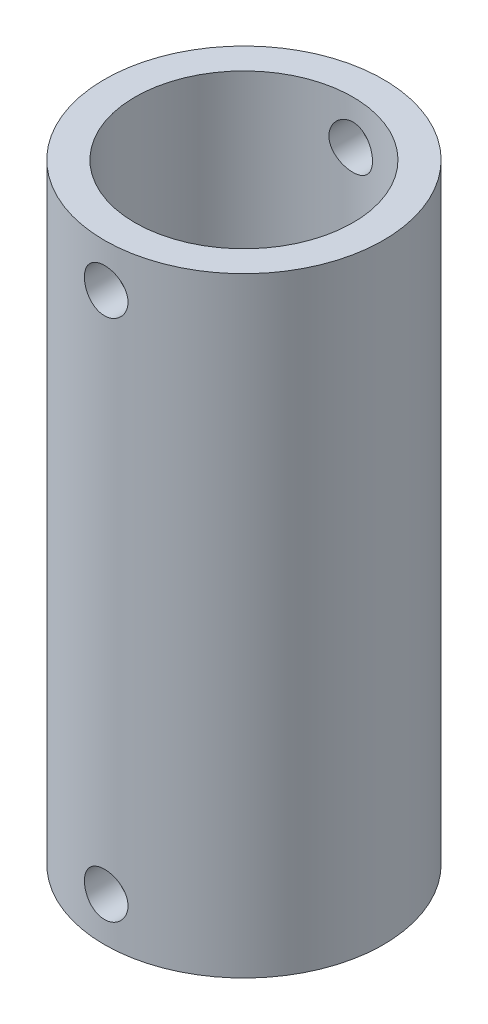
from build123d import *

# Parameters (mm, degrees)
SKETCH1_R          = 16
SKETCH1_R_2        = 12.5
EXTRUDE1_DEPTH     = 69.99
SKETCH2_R          = 2.5
CUT_EXTRUDE1_DEPTH = 20


with BuildPart() as part:
    # Sketch1 → Extrude1 (new body)
    with BuildSketch(Plane(origin=(0, 0, 0), x_dir=(1, 0, 0), z_dir=(0, 1, 0))):
        with Locations(Location((0, 0, 0), (0, 0, 90))):
            Circle(SKETCH1_R)
        with Locations(Location((0, 0, 0), (0, 0, 90))):
            Circle(SKETCH1_R_2, mode=Mode.SUBTRACT)
    extrude(amount=EXTRUDE1_DEPTH)

    # Sketch2 → Cut-Extrude1 (cut, symmetric)
    with BuildSketch(Plane.XY):
        with Locations((0, 65)):
            Circle(SKETCH2_R)
        with Locations((0, 5)):
            Circle(SKETCH2_R)
    extrude(amount=CUT_EXTRUDE1_DEPTH, both=True, mode=Mode.SUBTRACT)


solid = part.part
